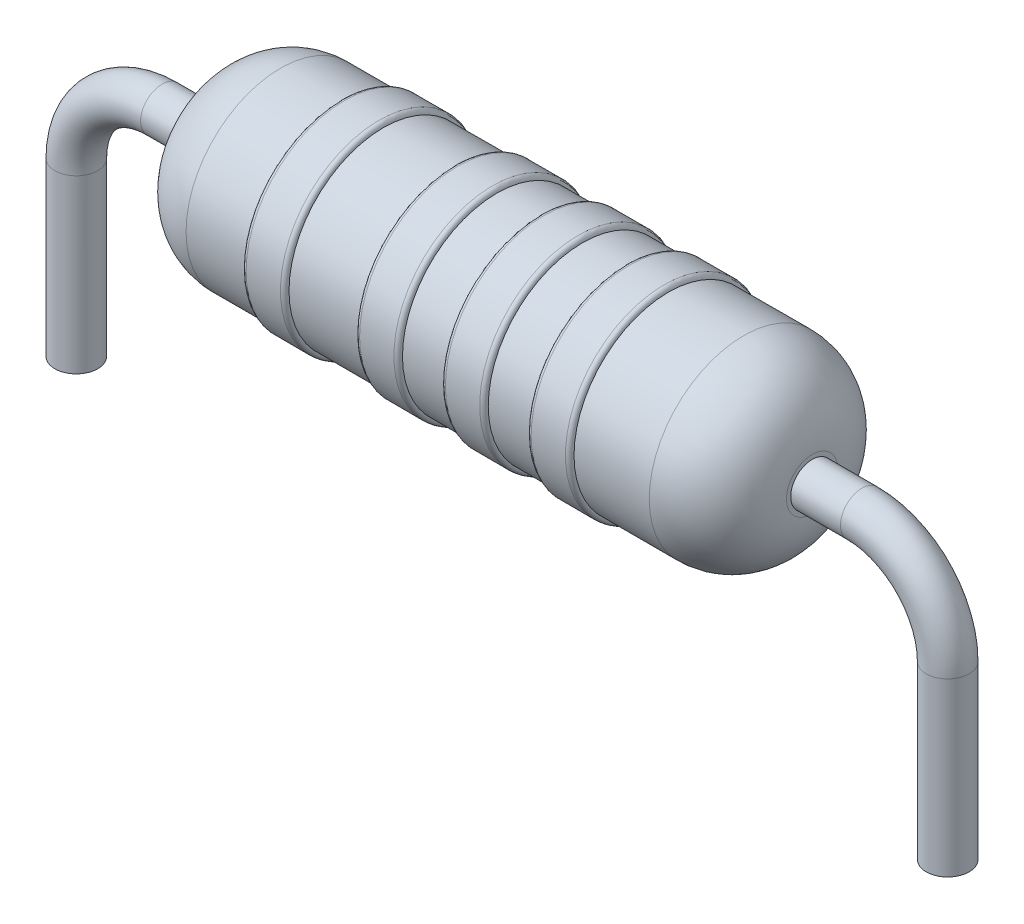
ISO-10303-21;
HEADER;
FILE_DESCRIPTION(('STEP AP214'),'2;1');
FILE_NAME('part.step','',(''),(''),'','','');
FILE_SCHEMA(('AUTOMOTIVE_DESIGN { 1 0 10303 214 1 1 1 1 }'));
ENDSEC;
DATA;
#1=APPLICATION_CONTEXT('core data for automotive mechanical design processes');
#2=APPLICATION_PROTOCOL_DEFINITION('international standard','automotive_design',2000,#1);
#3=PRODUCT_CONTEXT('',#1,'mechanical');
#4=PRODUCT('Part','Part','',(#3));
#5=PRODUCT_RELATED_PRODUCT_CATEGORY('part','',(#4));
#6=PRODUCT_DEFINITION_FORMATION('','',#4);
#7=PRODUCT_DEFINITION_CONTEXT('part definition',#1,'design');
#8=PRODUCT_DEFINITION('design','',#6,#7);
#9=PRODUCT_DEFINITION_SHAPE('','',#8);
#10=(LENGTH_UNIT() NAMED_UNIT(*) SI_UNIT(.MILLI.,.METRE.));
#11=(NAMED_UNIT(*) PLANE_ANGLE_UNIT() SI_UNIT($,.RADIAN.));
#12=(NAMED_UNIT(*) SI_UNIT($,.STERADIAN.) SOLID_ANGLE_UNIT());
#13=UNCERTAINTY_MEASURE_WITH_UNIT(LENGTH_MEASURE(1.E-05),#10,'distance_accuracy_value','');
#14=(GEOMETRIC_REPRESENTATION_CONTEXT(3) GLOBAL_UNCERTAINTY_ASSIGNED_CONTEXT((#13)) GLOBAL_UNIT_ASSIGNED_CONTEXT((#10,
#11,#12)) REPRESENTATION_CONTEXT('',''));
#15=CARTESIAN_POINT('',(0.,0.,0.));
#16=DIRECTION('',(0.,0.,1.));
#17=DIRECTION('',(1.,0.,0.));
#18=AXIS2_PLACEMENT_3D('',#15,#16,#17);
#19=CARTESIAN_POINT('',(-3.5,0.,0.));
#20=DIRECTION('',(1.,0.,0.));
#21=DIRECTION('',(0.,0.,-1.));
#22=AXIS2_PLACEMENT_3D('',#19,#20,#21);
#23=PLANE('',#22);
#24=CARTESIAN_POINT('',(-3.5,0.,0.));
#25=DIRECTION('',(-1.,0.,0.));
#26=DIRECTION('',(0.,0.,1.));
#27=AXIS2_PLACEMENT_3D('',#24,#25,#26);
#28=CIRCLE('',#27,0.299999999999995);
#29=CARTESIAN_POINT('',(-3.5,0.,0.299999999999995));
#30=VERTEX_POINT('',#29);
#31=EDGE_CURVE('E98',#30,#30,#28,.T.);
#32=ORIENTED_EDGE('',*,*,#31,.T.);
#33=EDGE_LOOP('',(#32));
#34=FACE_BOUND('',#33,.T.);
#35=CARTESIAN_POINT('',(-3.5,0.,0.));
#36=DIRECTION('',(1.,0.,0.));
#37=DIRECTION('',(0.,0.,-1.));
#38=AXIS2_PLACEMENT_3D('',#35,#36,#37);
#39=CIRCLE('',#38,0.25);
#40=CARTESIAN_POINT('',(-3.5,0.,-0.25));
#41=VERTEX_POINT('',#40);
#42=EDGE_CURVE('E10',#41,#41,#39,.F.);
#43=ORIENTED_EDGE('',*,*,#42,.F.);
#44=EDGE_LOOP('',(#43));
#45=FACE_BOUND('',#44,.T.);
#46=ADVANCED_FACE('F39',(#34,#45),#23,.F.);
#47=CARTESIAN_POINT('',(-54.2686615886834,0.,0.));
#48=DIRECTION('',(-1.,0.,0.));
#49=DIRECTION('',(0.,0.,1.));
#50=AXIS2_PLACEMENT_3D('',#47,#48,#49);
#51=CYLINDRICAL_SURFACE('',#50,1.1);
#52=CARTESIAN_POINT('',(0.322975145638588,0.,0.));
#53=DIRECTION('',(-1.,0.,0.));
#54=DIRECTION('',(0.,0.,1.));
#55=AXIS2_PLACEMENT_3D('',#52,#53,#54);
#56=CIRCLE('',#55,1.1);
#57=CARTESIAN_POINT('',(0.322975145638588,0.,1.1));
#58=VERTEX_POINT('',#57);
#59=EDGE_CURVE('E86',#58,#58,#56,.T.);
#60=ORIENTED_EDGE('',*,*,#59,.T.);
#61=EDGE_LOOP('',(#60));
#62=FACE_BOUND('',#61,.T.);
#63=CARTESIAN_POINT('',(-0.177024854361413,0.,0.));
#64=DIRECTION('',(1.,0.,0.));
#65=DIRECTION('',(0.,0.,-1.));
#66=AXIS2_PLACEMENT_3D('',#63,#64,#65);
#67=CIRCLE('',#66,1.1);
#68=CARTESIAN_POINT('',(-0.177024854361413,0.,-1.1));
#69=VERTEX_POINT('',#68);
#70=EDGE_CURVE('E95',#69,#69,#67,.T.);
#71=ORIENTED_EDGE('',*,*,#70,.T.);
#72=EDGE_LOOP('',(#71));
#73=FACE_BOUND('',#72,.T.);
#74=ADVANCED_FACE('F150',(#62,#73),#51,.T.);
#75=CARTESIAN_POINT('',(4.3261723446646,0.,0.));
#76=DIRECTION('',(1.,0.,0.));
#77=DIRECTION('',(0.,0.,-1.));
#78=AXIS2_PLACEMENT_3D('',#75,#76,#77);
#79=CYLINDRICAL_SURFACE('',#78,1.15);
#80=CARTESIAN_POINT('',(-0.627024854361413,0.,0.));
#81=DIRECTION('',(-1.,0.,0.));
#82=DIRECTION('',(0.,0.,1.));
#83=AXIS2_PLACEMENT_3D('',#80,#81,#82);
#84=CIRCLE('',#83,1.15);
#85=CARTESIAN_POINT('',(-0.627024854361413,0.,1.15));
#86=VERTEX_POINT('',#85);
#87=EDGE_CURVE('E62',#86,#86,#84,.F.);
#88=ORIENTED_EDGE('',*,*,#87,.T.);
#89=EDGE_LOOP('',(#88));
#90=FACE_BOUND('',#89,.T.);
#91=CARTESIAN_POINT('',(-0.227024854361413,0.,0.));
#92=DIRECTION('',(1.,0.,0.));
#93=DIRECTION('',(0.,0.,-1.));
#94=AXIS2_PLACEMENT_3D('',#91,#92,#93);
#95=CIRCLE('',#94,1.15);
#96=CARTESIAN_POINT('',(-0.227024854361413,0.,-1.15));
#97=VERTEX_POINT('',#96);
#98=EDGE_CURVE('E65',#97,#97,#95,.F.);
#99=ORIENTED_EDGE('',*,*,#98,.T.);
#100=EDGE_LOOP('',(#99));
#101=FACE_BOUND('',#100,.T.);
#102=ADVANCED_FACE('F156',(#90,#101),#79,.T.);
#103=CARTESIAN_POINT('',(-1.5,0.,0.));
#104=DIRECTION('',(1.,0.,0.));
#105=DIRECTION('',(0.,0.,-1.));
#106=AXIS2_PLACEMENT_3D('',#103,#104,#105);
#107=CIRCLE('',#106,1.1);
#108=CARTESIAN_POINT('',(-1.5,0.,-1.1));
#109=VERTEX_POINT('',#108);
#110=EDGE_CURVE('E79',#109,#109,#107,.T.);
#111=ORIENTED_EDGE('',*,*,#110,.T.);
#112=EDGE_LOOP('',(#111));
#113=FACE_BOUND('',#112,.T.);
#114=CARTESIAN_POINT('',(-0.677024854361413,0.,0.));
#115=DIRECTION('',(-1.,0.,0.));
#116=DIRECTION('',(0.,0.,1.));
#117=AXIS2_PLACEMENT_3D('',#114,#115,#116);
#118=CIRCLE('',#117,1.1);
#119=CARTESIAN_POINT('',(-0.677024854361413,0.,1.1));
#120=VERTEX_POINT('',#119);
#121=EDGE_CURVE('E92',#120,#120,#118,.T.);
#122=ORIENTED_EDGE('',*,*,#121,.T.);
#123=EDGE_LOOP('',(#122));
#124=FACE_BOUND('',#123,.T.);
#125=ADVANCED_FACE('F159',(#113,#124),#51,.T.);
#126=CARTESIAN_POINT('',(4.3261723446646,0.,0.));
#127=DIRECTION('',(1.,0.,0.));
#128=DIRECTION('',(0.,0.,-1.));
#129=AXIS2_PLACEMENT_3D('',#126,#127,#128);
#130=CYLINDRICAL_SURFACE('',#129,1.15);
#131=CARTESIAN_POINT('',(0.372975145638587,0.,0.));
#132=DIRECTION('',(-1.,0.,0.));
#133=DIRECTION('',(0.,0.,1.));
#134=AXIS2_PLACEMENT_3D('',#131,#132,#133);
#135=CIRCLE('',#134,1.15);
#136=CARTESIAN_POINT('',(0.372975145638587,0.,1.15));
#137=VERTEX_POINT('',#136);
#138=EDGE_CURVE('E54',#137,#137,#135,.F.);
#139=ORIENTED_EDGE('',*,*,#138,.T.);
#140=EDGE_LOOP('',(#139));
#141=FACE_BOUND('',#140,.T.);
#142=CARTESIAN_POINT('',(0.772975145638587,0.,0.));
#143=DIRECTION('',(1.,0.,0.));
#144=DIRECTION('',(0.,0.,-1.));
#145=AXIS2_PLACEMENT_3D('',#142,#143,#144);
#146=CIRCLE('',#145,1.15);
#147=CARTESIAN_POINT('',(0.772975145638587,0.,-1.15));
#148=VERTEX_POINT('',#147);
#149=EDGE_CURVE('E59',#148,#148,#146,.F.);
#150=ORIENTED_EDGE('',*,*,#149,.T.);
#151=EDGE_LOOP('',(#150));
#152=FACE_BOUND('',#151,.T.);
#153=ADVANCED_FACE('F171',(#141,#152),#130,.T.);
#154=CARTESIAN_POINT('',(1.32297514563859,0.,0.));
#155=DIRECTION('',(-1.,0.,0.));
#156=DIRECTION('',(0.,0.,1.));
#157=AXIS2_PLACEMENT_3D('',#154,#155,#156);
#158=CIRCLE('',#157,1.1);
#159=CARTESIAN_POINT('',(1.32297514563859,0.,1.1));
#160=VERTEX_POINT('',#159);
#161=EDGE_CURVE('E78',#160,#160,#158,.T.);
#162=ORIENTED_EDGE('',*,*,#161,.T.);
#163=EDGE_LOOP('',(#162));
#164=FACE_BOUND('',#163,.T.);
#165=CARTESIAN_POINT('',(0.822975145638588,0.,0.));
#166=DIRECTION('',(1.,0.,0.));
#167=DIRECTION('',(0.,0.,-1.));
#168=AXIS2_PLACEMENT_3D('',#165,#166,#167);
#169=CIRCLE('',#168,1.1);
#170=CARTESIAN_POINT('',(0.822975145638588,0.,-1.1));
#171=VERTEX_POINT('',#170);
#172=EDGE_CURVE('E89',#171,#171,#169,.T.);
#173=ORIENTED_EDGE('',*,*,#172,.T.);
#174=EDGE_LOOP('',(#173));
#175=FACE_BOUND('',#174,.T.);
#176=ADVANCED_FACE('F160',(#164,#175),#51,.T.);
#177=CARTESIAN_POINT('',(4.3261723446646,0.,0.));
#178=DIRECTION('',(1.,0.,0.));
#179=DIRECTION('',(0.,0.,-1.));
#180=AXIS2_PLACEMENT_3D('',#177,#178,#179);
#181=CYLINDRICAL_SURFACE('',#180,1.15);
#182=CARTESIAN_POINT('',(1.37297514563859,0.,0.));
#183=DIRECTION('',(-1.,0.,0.));
#184=DIRECTION('',(0.,0.,1.));
#185=AXIS2_PLACEMENT_3D('',#182,#183,#184);
#186=CIRCLE('',#185,1.15);
#187=CARTESIAN_POINT('',(1.37297514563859,0.,1.15));
#188=VERTEX_POINT('',#187);
#189=EDGE_CURVE('E46',#188,#188,#186,.F.);
#190=ORIENTED_EDGE('',*,*,#189,.T.);
#191=EDGE_LOOP('',(#190));
#192=FACE_BOUND('',#191,.T.);
#193=CARTESIAN_POINT('',(1.77297514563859,0.,0.));
#194=DIRECTION('',(1.,0.,0.));
#195=DIRECTION('',(0.,0.,-1.));
#196=AXIS2_PLACEMENT_3D('',#193,#194,#195);
#197=CIRCLE('',#196,1.15);
#198=CARTESIAN_POINT('',(1.77297514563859,0.,-1.15));
#199=VERTEX_POINT('',#198);
#200=EDGE_CURVE('E50',#199,#199,#197,.F.);
#201=ORIENTED_EDGE('',*,*,#200,.T.);
#202=EDGE_LOOP('',(#201));
#203=FACE_BOUND('',#202,.T.);
#204=ADVANCED_FACE('F182',(#192,#203),#181,.T.);
#205=CARTESIAN_POINT('',(3.5,0.299999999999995,0.));
#206=DIRECTION('',(-1.,0.,0.));
#207=DIRECTION('',(0.,0.,1.));
#208=AXIS2_PLACEMENT_3D('',#205,#206,#207);
#209=PLANE('',#208);
#210=CARTESIAN_POINT('',(3.5,0.,0.));
#211=DIRECTION('',(-1.,0.,0.));
#212=DIRECTION('',(0.,0.,1.));
#213=AXIS2_PLACEMENT_3D('',#210,#211,#212);
#214=CIRCLE('',#213,0.25);
#215=CARTESIAN_POINT('',(3.5,0.,0.25));
#216=VERTEX_POINT('',#215);
#217=EDGE_CURVE('E128',#216,#216,#214,.T.);
#218=ORIENTED_EDGE('',*,*,#217,.T.);
#219=EDGE_LOOP('',(#218));
#220=FACE_BOUND('',#219,.T.);
#221=CARTESIAN_POINT('',(3.5,0.,0.));
#222=DIRECTION('',(-1.,0.,0.));
#223=DIRECTION('',(0.,0.,1.));
#224=AXIS2_PLACEMENT_3D('',#221,#222,#223);
#225=CIRCLE('',#224,0.299999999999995);
#226=CARTESIAN_POINT('',(3.5,0.,0.299999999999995));
#227=VERTEX_POINT('',#226);
#228=EDGE_CURVE('E74',#227,#227,#225,.T.);
#229=ORIENTED_EDGE('',*,*,#228,.F.);
#230=EDGE_LOOP('',(#229));
#231=FACE_BOUND('',#230,.T.);
#232=ADVANCED_FACE('F41',(#220,#231),#209,.F.);
#233=CARTESIAN_POINT('',(2.7,0.,0.));
#234=DIRECTION('',(-1.,0.,0.));
#235=DIRECTION('',(0.,0.,1.));
#236=AXIS2_PLACEMENT_3D('',#233,#234,#235);
#237=DEGENERATE_TOROIDAL_SURFACE('',#236,0.3,0.8,.T.);
#238=CARTESIAN_POINT('',(2.69999999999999,0.,0.));
#239=DIRECTION('',(-1.,0.,0.));
#240=DIRECTION('',(0.,0.,1.));
#241=AXIS2_PLACEMENT_3D('',#238,#239,#240);
#242=CIRCLE('',#241,1.1);
#243=CARTESIAN_POINT('',(2.69999999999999,0.,1.1));
#244=VERTEX_POINT('',#243);
#245=EDGE_CURVE('E103',#244,#244,#242,.T.);
#246=ORIENTED_EDGE('',*,*,#245,.F.);
#247=EDGE_LOOP('',(#246));
#248=FACE_BOUND('',#247,.T.);
#249=ORIENTED_EDGE('',*,*,#228,.T.);
#250=EDGE_LOOP('',(#249));
#251=FACE_BOUND('',#250,.T.);
#252=ADVANCED_FACE('F173',(#248,#251),#237,.T.);
#253=CARTESIAN_POINT('',(1.82297514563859,0.,0.));
#254=DIRECTION('',(1.,0.,0.));
#255=DIRECTION('',(0.,0.,-1.));
#256=AXIS2_PLACEMENT_3D('',#253,#254,#255);
#257=CIRCLE('',#256,1.1);
#258=CARTESIAN_POINT('',(1.82297514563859,0.,-1.1));
#259=VERTEX_POINT('',#258);
#260=EDGE_CURVE('E83',#259,#259,#257,.T.);
#261=ORIENTED_EDGE('',*,*,#260,.T.);
#262=EDGE_LOOP('',(#261));
#263=FACE_BOUND('',#262,.T.);
#264=ORIENTED_EDGE('',*,*,#245,.T.);
#265=EDGE_LOOP('',(#264));
#266=FACE_BOUND('',#265,.T.);
#267=ADVANCED_FACE('F175',(#263,#266),#51,.T.);
#268=CARTESIAN_POINT('',(4.3261723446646,0.,0.));
#269=DIRECTION('',(1.,0.,0.));
#270=DIRECTION('',(0.,0.,-1.));
#271=AXIS2_PLACEMENT_3D('',#268,#269,#270);
#272=CYLINDRICAL_SURFACE('',#271,1.15);
#273=CARTESIAN_POINT('',(-1.95,0.,0.));
#274=DIRECTION('',(-1.,0.,0.));
#275=DIRECTION('',(0.,0.,1.));
#276=AXIS2_PLACEMENT_3D('',#273,#274,#275);
#277=CIRCLE('',#276,1.15);
#278=CARTESIAN_POINT('',(-1.95,0.,1.15));
#279=VERTEX_POINT('',#278);
#280=EDGE_CURVE('E68',#279,#279,#277,.F.);
#281=ORIENTED_EDGE('',*,*,#280,.T.);
#282=EDGE_LOOP('',(#281));
#283=FACE_BOUND('',#282,.T.);
#284=CARTESIAN_POINT('',(-1.55,0.,0.));
#285=DIRECTION('',(1.,0.,0.));
#286=DIRECTION('',(0.,0.,-1.));
#287=AXIS2_PLACEMENT_3D('',#284,#285,#286);
#288=CIRCLE('',#287,1.15);
#289=CARTESIAN_POINT('',(-1.55,0.,-1.15));
#290=VERTEX_POINT('',#289);
#291=EDGE_CURVE('E71',#290,#290,#288,.F.);
#292=ORIENTED_EDGE('',*,*,#291,.T.);
#293=EDGE_LOOP('',(#292));
#294=FACE_BOUND('',#293,.T.);
#295=ADVANCED_FACE('F168',(#283,#294),#272,.T.);
#296=CARTESIAN_POINT('',(-2.7,0.,0.));
#297=DIRECTION('',(-1.,0.,0.));
#298=DIRECTION('',(0.,0.,1.));
#299=AXIS2_PLACEMENT_3D('',#296,#297,#298);
#300=DEGENERATE_TOROIDAL_SURFACE('',#299,0.3,0.8,.T.);
#301=ORIENTED_EDGE('',*,*,#31,.F.);
#302=EDGE_LOOP('',(#301));
#303=FACE_BOUND('',#302,.T.);
#304=CARTESIAN_POINT('',(-2.69999999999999,0.,0.));
#305=DIRECTION('',(-1.,0.,0.));
#306=DIRECTION('',(0.,0.,1.));
#307=AXIS2_PLACEMENT_3D('',#304,#305,#306);
#308=CIRCLE('',#307,1.1);
#309=CARTESIAN_POINT('',(-2.69999999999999,0.,1.1));
#310=VERTEX_POINT('',#309);
#311=EDGE_CURVE('E106',#310,#310,#308,.T.);
#312=ORIENTED_EDGE('',*,*,#311,.T.);
#313=EDGE_LOOP('',(#312));
#314=FACE_BOUND('',#313,.T.);
#315=ADVANCED_FACE('F165',(#303,#314),#300,.T.);
#316=CARTESIAN_POINT('',(-2.,0.,0.));
#317=DIRECTION('',(-1.,0.,0.));
#318=DIRECTION('',(0.,0.,1.));
#319=AXIS2_PLACEMENT_3D('',#316,#317,#318);
#320=CIRCLE('',#319,1.1);
#321=CARTESIAN_POINT('',(-2.,0.,1.1));
#322=VERTEX_POINT('',#321);
#323=EDGE_CURVE('E75',#322,#322,#320,.T.);
#324=ORIENTED_EDGE('',*,*,#323,.T.);
#325=EDGE_LOOP('',(#324));
#326=FACE_BOUND('',#325,.T.);
#327=ORIENTED_EDGE('',*,*,#311,.F.);
#328=EDGE_LOOP('',(#327));
#329=FACE_BOUND('',#328,.T.);
#330=ADVANCED_FACE('F167',(#326,#329),#51,.T.);
#331=CARTESIAN_POINT('',(-1.95,0.,0.));
#332=DIRECTION('',(-1.,0.,0.));
#333=DIRECTION('',(0.,0.,1.));
#334=AXIS2_PLACEMENT_3D('',#331,#332,#333);
#335=TOROIDAL_SURFACE('',#334,1.1,0.05);
#336=ORIENTED_EDGE('',*,*,#323,.F.);
#337=EDGE_LOOP('',(#336));
#338=FACE_BOUND('',#337,.T.);
#339=ORIENTED_EDGE('',*,*,#280,.F.);
#340=EDGE_LOOP('',(#339));
#341=FACE_BOUND('',#340,.T.);
#342=ADVANCED_FACE('F235',(#338,#341),#335,.T.);
#343=CARTESIAN_POINT('',(-1.55,0.,0.));
#344=DIRECTION('',(1.,0.,0.));
#345=DIRECTION('',(0.,0.,-1.));
#346=AXIS2_PLACEMENT_3D('',#343,#344,#345);
#347=TOROIDAL_SURFACE('',#346,1.1,0.05);
#348=ORIENTED_EDGE('',*,*,#291,.F.);
#349=EDGE_LOOP('',(#348));
#350=FACE_BOUND('',#349,.T.);
#351=ORIENTED_EDGE('',*,*,#110,.F.);
#352=EDGE_LOOP('',(#351));
#353=FACE_BOUND('',#352,.T.);
#354=ADVANCED_FACE('F232',(#350,#353),#347,.T.);
#355=CARTESIAN_POINT('',(-0.627024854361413,0.,0.));
#356=DIRECTION('',(-1.,0.,0.));
#357=DIRECTION('',(0.,0.,1.));
#358=AXIS2_PLACEMENT_3D('',#355,#356,#357);
#359=TOROIDAL_SURFACE('',#358,1.1,0.05);
#360=ORIENTED_EDGE('',*,*,#121,.F.);
#361=EDGE_LOOP('',(#360));
#362=FACE_BOUND('',#361,.T.);
#363=ORIENTED_EDGE('',*,*,#87,.F.);
#364=EDGE_LOOP('',(#363));
#365=FACE_BOUND('',#364,.T.);
#366=ADVANCED_FACE('F228',(#362,#365),#359,.T.);
#367=CARTESIAN_POINT('',(-0.227024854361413,0.,0.));
#368=DIRECTION('',(1.,0.,0.));
#369=DIRECTION('',(0.,0.,-1.));
#370=AXIS2_PLACEMENT_3D('',#367,#368,#369);
#371=TOROIDAL_SURFACE('',#370,1.1,0.05);
#372=ORIENTED_EDGE('',*,*,#98,.F.);
#373=EDGE_LOOP('',(#372));
#374=FACE_BOUND('',#373,.T.);
#375=ORIENTED_EDGE('',*,*,#70,.F.);
#376=EDGE_LOOP('',(#375));
#377=FACE_BOUND('',#376,.T.);
#378=ADVANCED_FACE('F221',(#374,#377),#371,.T.);
#379=CARTESIAN_POINT('',(0.372975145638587,0.,0.));
#380=DIRECTION('',(-1.,0.,0.));
#381=DIRECTION('',(0.,0.,1.));
#382=AXIS2_PLACEMENT_3D('',#379,#380,#381);
#383=TOROIDAL_SURFACE('',#382,1.1,0.05);
#384=ORIENTED_EDGE('',*,*,#59,.F.);
#385=EDGE_LOOP('',(#384));
#386=FACE_BOUND('',#385,.T.);
#387=ORIENTED_EDGE('',*,*,#138,.F.);
#388=EDGE_LOOP('',(#387));
#389=FACE_BOUND('',#388,.T.);
#390=ADVANCED_FACE('F210',(#386,#389),#383,.T.);
#391=CARTESIAN_POINT('',(0.772975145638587,0.,0.));
#392=DIRECTION('',(1.,0.,0.));
#393=DIRECTION('',(0.,0.,-1.));
#394=AXIS2_PLACEMENT_3D('',#391,#392,#393);
#395=TOROIDAL_SURFACE('',#394,1.1,0.05);
#396=ORIENTED_EDGE('',*,*,#149,.F.);
#397=EDGE_LOOP('',(#396));
#398=FACE_BOUND('',#397,.T.);
#399=ORIENTED_EDGE('',*,*,#172,.F.);
#400=EDGE_LOOP('',(#399));
#401=FACE_BOUND('',#400,.T.);
#402=ADVANCED_FACE('F206',(#398,#401),#395,.T.);
#403=CARTESIAN_POINT('',(1.37297514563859,0.,0.));
#404=DIRECTION('',(-1.,0.,0.));
#405=DIRECTION('',(0.,0.,1.));
#406=AXIS2_PLACEMENT_3D('',#403,#404,#405);
#407=TOROIDAL_SURFACE('',#406,1.1,0.05);
#408=ORIENTED_EDGE('',*,*,#161,.F.);
#409=EDGE_LOOP('',(#408));
#410=FACE_BOUND('',#409,.T.);
#411=ORIENTED_EDGE('',*,*,#189,.F.);
#412=EDGE_LOOP('',(#411));
#413=FACE_BOUND('',#412,.T.);
#414=ADVANCED_FACE('F209',(#410,#413),#407,.T.);
#415=CARTESIAN_POINT('',(1.77297514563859,0.,0.));
#416=DIRECTION('',(1.,0.,0.));
#417=DIRECTION('',(0.,0.,-1.));
#418=AXIS2_PLACEMENT_3D('',#415,#416,#417);
#419=TOROIDAL_SURFACE('',#418,1.1,0.05);
#420=ORIENTED_EDGE('',*,*,#200,.F.);
#421=EDGE_LOOP('',(#420));
#422=FACE_BOUND('',#421,.T.);
#423=ORIENTED_EDGE('',*,*,#260,.F.);
#424=EDGE_LOOP('',(#423));
#425=FACE_BOUND('',#424,.T.);
#426=ADVANCED_FACE('F218',(#422,#425),#419,.T.);
#427=CARTESIAN_POINT('',(-5.08,-1.00000000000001,0.));
#428=DIRECTION('',(0.,-1.,0.));
#429=DIRECTION('',(1.,0.,0.));
#430=AXIS2_PLACEMENT_3D('',#427,#428,#429);
#431=CYLINDRICAL_SURFACE('',#430,0.25);
#432=CARTESIAN_POINT('',(-5.08,-1.00000000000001,0.));
#433=DIRECTION('',(0.,-1.,0.));
#434=DIRECTION('',(0.,0.,1.));
#435=AXIS2_PLACEMENT_3D('',#432,#433,#434);
#436=CIRCLE('',#435,0.25);
#437=CARTESIAN_POINT('',(-5.33,-1.00000000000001,0.));
#438=VERTEX_POINT('',#437);
#439=EDGE_CURVE('E113',#438,#438,#436,.T.);
#440=ORIENTED_EDGE('',*,*,#439,.T.);
#441=EDGE_LOOP('',(#440));
#442=FACE_BOUND('',#441,.T.);
#443=CARTESIAN_POINT('',(-5.08,-3.,0.));
#444=DIRECTION('',(0.,-1.,0.));
#445=DIRECTION('',(0.,0.,1.));
#446=AXIS2_PLACEMENT_3D('',#443,#444,#445);
#447=CIRCLE('',#446,0.25);
#448=CARTESIAN_POINT('',(-5.08,-3.,0.25));
#449=VERTEX_POINT('',#448);
#450=EDGE_CURVE('E82',#449,#449,#447,.T.);
#451=ORIENTED_EDGE('',*,*,#450,.F.);
#452=EDGE_LOOP('',(#451));
#453=FACE_BOUND('',#452,.T.);
#454=ADVANCED_FACE('F376',(#442,#453),#431,.T.);
#455=CARTESIAN_POINT('',(-4.08,-1.,0.));
#456=DIRECTION('',(0.,0.,1.));
#457=DIRECTION('',(1.,0.,0.));
#458=AXIS2_PLACEMENT_3D('',#455,#456,#457);
#459=TOROIDAL_SURFACE('',#458,1.,0.25);
#460=CARTESIAN_POINT('',(-4.07999999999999,0.,0.));
#461=DIRECTION('',(-1.,0.,0.));
#462=DIRECTION('',(0.,0.,1.));
#463=AXIS2_PLACEMENT_3D('',#460,#461,#462);
#464=CIRCLE('',#463,0.25);
#465=CARTESIAN_POINT('',(-4.07999999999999,0.25,0.));
#466=VERTEX_POINT('',#465);
#467=EDGE_CURVE('E116',#466,#466,#464,.T.);
#468=CARTESIAN_POINT('',(-4.08,-1.,0.));
#469=DIRECTION('',(0.,0.,1.));
#470=DIRECTION('',(1.,0.,0.));
#471=AXIS2_PLACEMENT_3D('',#468,#469,#470);
#472=CIRCLE('',#471,1.25);
#473=EDGE_CURVE('',#466,#438,#472,.T.);
#474=ORIENTED_EDGE('',*,*,#467,.T.);
#475=ORIENTED_EDGE('',*,*,#439,.F.);
#476=ORIENTED_EDGE('',*,*,#473,.T.);
#477=ORIENTED_EDGE('',*,*,#473,.F.);
#478=EDGE_LOOP('',(#474,#476,#475,#477));
#479=FACE_BOUND('',#478,.T.);
#480=ADVANCED_FACE('F390',(#479),#459,.T.);
#481=CARTESIAN_POINT('',(-4.07999999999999,0.,0.));
#482=DIRECTION('',(1.,0.,0.));
#483=DIRECTION('',(0.,0.,-1.));
#484=AXIS2_PLACEMENT_3D('',#481,#482,#483);
#485=CYLINDRICAL_SURFACE('',#484,0.25);
#486=ORIENTED_EDGE('',*,*,#467,.F.);
#487=EDGE_LOOP('',(#486));
#488=FACE_BOUND('',#487,.T.);
#489=ORIENTED_EDGE('',*,*,#42,.T.);
#490=EDGE_LOOP('',(#489));
#491=FACE_BOUND('',#490,.T.);
#492=ADVANCED_FACE('F400',(#488,#491),#485,.T.);
#493=CARTESIAN_POINT('',(-5.08,-3.,0.));
#494=DIRECTION('',(0.,-1.,0.));
#495=DIRECTION('',(0.,0.,1.));
#496=AXIS2_PLACEMENT_3D('',#493,#494,#495);
#497=PLANE('',#496);
#498=ORIENTED_EDGE('',*,*,#450,.T.);
#499=EDGE_LOOP('',(#498));
#500=FACE_BOUND('',#499,.T.);
#501=ADVANCED_FACE('F410',(#500),#497,.T.);
#502=CARTESIAN_POINT('',(5.08,-1.00000000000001,0.));
#503=DIRECTION('',(0.,-1.,0.));
#504=DIRECTION('',(1.,0.,0.));
#505=AXIS2_PLACEMENT_3D('',#502,#503,#504);
#506=CYLINDRICAL_SURFACE('',#505,0.25);
#507=CARTESIAN_POINT('',(5.08,-1.00000000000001,0.));
#508=DIRECTION('',(0.,1.,0.));
#509=DIRECTION('',(0.,0.,1.));
#510=AXIS2_PLACEMENT_3D('',#507,#508,#509);
#511=CIRCLE('',#510,0.25);
#512=CARTESIAN_POINT('',(5.33,-1.00000000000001,0.));
#513=VERTEX_POINT('',#512);
#514=EDGE_CURVE('E122',#513,#513,#511,.T.);
#515=ORIENTED_EDGE('',*,*,#514,.F.);
#516=EDGE_LOOP('',(#515));
#517=FACE_BOUND('',#516,.T.);
#518=CARTESIAN_POINT('',(5.08,-3.,0.));
#519=DIRECTION('',(0.,1.,0.));
#520=DIRECTION('',(0.,0.,1.));
#521=AXIS2_PLACEMENT_3D('',#518,#519,#520);
#522=CIRCLE('',#521,0.25);
#523=CARTESIAN_POINT('',(5.08,-3.,0.25));
#524=VERTEX_POINT('',#523);
#525=EDGE_CURVE('E119',#524,#524,#522,.T.);
#526=ORIENTED_EDGE('',*,*,#525,.T.);
#527=EDGE_LOOP('',(#526));
#528=FACE_BOUND('',#527,.T.);
#529=ADVANCED_FACE('F146',(#517,#528),#506,.T.);
#530=CARTESIAN_POINT('',(4.08,-1.,0.));
#531=DIRECTION('',(0.,0.,-1.));
#532=DIRECTION('',(-1.,0.,0.));
#533=AXIS2_PLACEMENT_3D('',#530,#531,#532);
#534=TOROIDAL_SURFACE('',#533,1.,0.25);
#535=CARTESIAN_POINT('',(4.07999999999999,0.,0.));
#536=DIRECTION('',(-1.,0.,0.));
#537=DIRECTION('',(0.,0.,1.));
#538=AXIS2_PLACEMENT_3D('',#535,#536,#537);
#539=CIRCLE('',#538,0.25);
#540=CARTESIAN_POINT('',(4.07999999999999,0.25,0.));
#541=VERTEX_POINT('',#540);
#542=EDGE_CURVE('E125',#541,#541,#539,.T.);
#543=CARTESIAN_POINT('',(4.08,-1.,0.));
#544=DIRECTION('',(0.,0.,-1.));
#545=DIRECTION('',(-1.,0.,0.));
#546=AXIS2_PLACEMENT_3D('',#543,#544,#545);
#547=CIRCLE('',#546,1.25);
#548=EDGE_CURVE('',#541,#513,#547,.T.);
#549=ORIENTED_EDGE('',*,*,#542,.F.);
#550=ORIENTED_EDGE('',*,*,#514,.T.);
#551=ORIENTED_EDGE('',*,*,#548,.T.);
#552=ORIENTED_EDGE('',*,*,#548,.F.);
#553=EDGE_LOOP('',(#549,#551,#550,#552));
#554=FACE_BOUND('',#553,.T.);
#555=ADVANCED_FACE('F137',(#554),#534,.T.);
#556=CARTESIAN_POINT('',(4.07999999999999,0.,0.));
#557=DIRECTION('',(-1.,0.,0.));
#558=DIRECTION('',(0.,0.,1.));
#559=AXIS2_PLACEMENT_3D('',#556,#557,#558);
#560=CYLINDRICAL_SURFACE('',#559,0.25);
#561=ORIENTED_EDGE('',*,*,#542,.T.);
#562=EDGE_LOOP('',(#561));
#563=FACE_BOUND('',#562,.T.);
#564=ORIENTED_EDGE('',*,*,#217,.F.);
#565=EDGE_LOOP('',(#564));
#566=FACE_BOUND('',#565,.T.);
#567=ADVANCED_FACE('F134',(#563,#566),#560,.T.);
#568=CARTESIAN_POINT('',(5.08,-3.,0.));
#569=DIRECTION('',(0.,-1.,0.));
#570=DIRECTION('',(0.,0.,1.));
#571=AXIS2_PLACEMENT_3D('',#568,#569,#570);
#572=PLANE('',#571);
#573=ORIENTED_EDGE('',*,*,#525,.F.);
#574=EDGE_LOOP('',(#573));
#575=FACE_BOUND('',#574,.T.);
#576=ADVANCED_FACE('F136',(#575),#572,.T.);
#577=CLOSED_SHELL('',(#46,#74,#102,#125,#153,#176,#204,#232,#252,#267,#295,#315,#330,#342,#354,
#366,#378,#390,#402,#414,#426,#454,#480,#492,#501,#529,#555,#567,#576));
#578=MANIFOLD_SOLID_BREP('B2',#577);
#579=ADVANCED_BREP_SHAPE_REPRESENTATION('',(#18,#578),#14);
#580=SHAPE_DEFINITION_REPRESENTATION(#9,#579);
ENDSEC;
END-ISO-10303-21;
